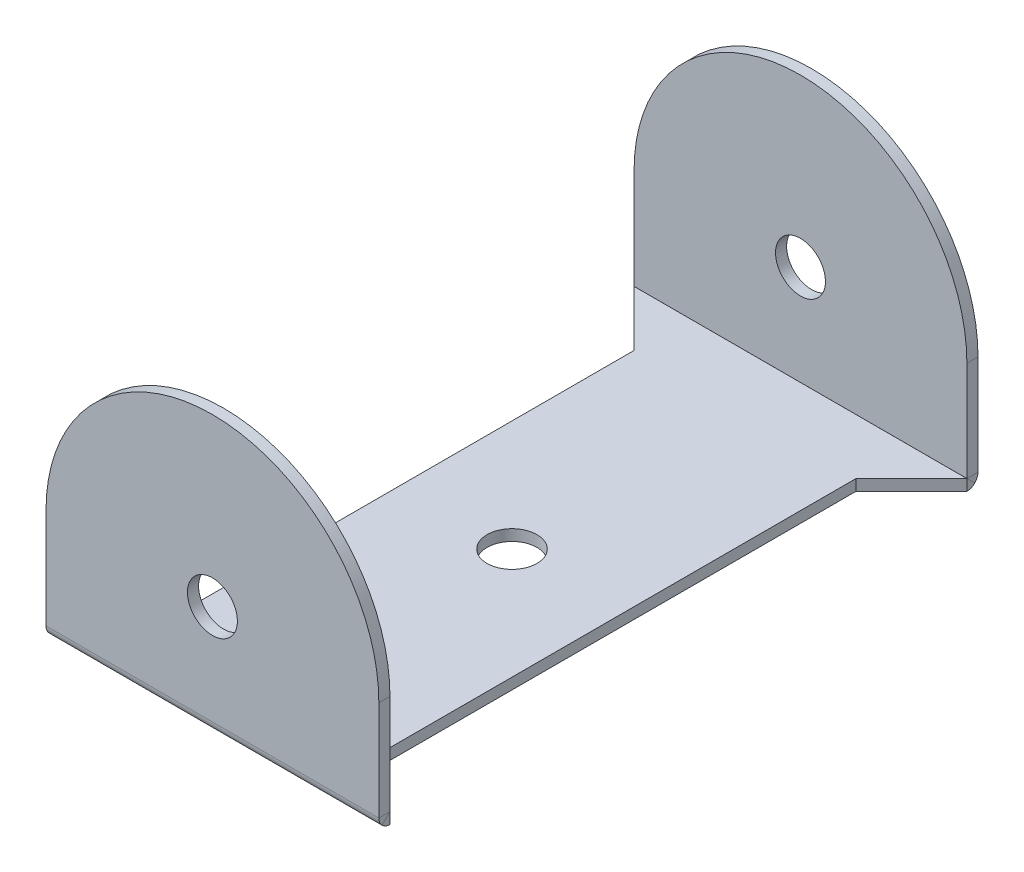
ISO-10303-21;
HEADER;
FILE_DESCRIPTION(('STEP AP214'),'2;1');
FILE_NAME('part.step','',(''),(''),'','','');
FILE_SCHEMA(('AUTOMOTIVE_DESIGN { 1 0 10303 214 1 1 1 1 }'));
ENDSEC;
DATA;
#1=APPLICATION_CONTEXT('core data for automotive mechanical design processes');
#2=APPLICATION_PROTOCOL_DEFINITION('international standard','automotive_design',2000,#1);
#3=PRODUCT_CONTEXT('',#1,'mechanical');
#4=PRODUCT('Part','Part','',(#3));
#5=PRODUCT_RELATED_PRODUCT_CATEGORY('part','',(#4));
#6=PRODUCT_DEFINITION_FORMATION('','',#4);
#7=PRODUCT_DEFINITION_CONTEXT('part definition',#1,'design');
#8=PRODUCT_DEFINITION('design','',#6,#7);
#9=PRODUCT_DEFINITION_SHAPE('','',#8);
#10=(LENGTH_UNIT() NAMED_UNIT(*) SI_UNIT(.MILLI.,.METRE.));
#11=(NAMED_UNIT(*) PLANE_ANGLE_UNIT() SI_UNIT($,.RADIAN.));
#12=(NAMED_UNIT(*) SI_UNIT($,.STERADIAN.) SOLID_ANGLE_UNIT());
#13=UNCERTAINTY_MEASURE_WITH_UNIT(LENGTH_MEASURE(1.E-05),#10,'distance_accuracy_value','');
#14=(GEOMETRIC_REPRESENTATION_CONTEXT(3) GLOBAL_UNCERTAINTY_ASSIGNED_CONTEXT((#13)) GLOBAL_UNIT_ASSIGNED_CONTEXT((#10,
#11,#12)) REPRESENTATION_CONTEXT('',''));
#15=CARTESIAN_POINT('',(0.,0.,0.));
#16=DIRECTION('',(0.,0.,1.));
#17=DIRECTION('',(1.,0.,0.));
#18=AXIS2_PLACEMENT_3D('',#15,#16,#17);
#19=CARTESIAN_POINT('',(10.,1.,-35.));
#20=DIRECTION('',(0.,1.,0.));
#21=DIRECTION('',(0.,0.,1.));
#22=AXIS2_PLACEMENT_3D('',#19,#20,#21);
#23=PLANE('',#22);
#24=CARTESIAN_POINT('',(10.,1.,0.));
#25=DIRECTION('',(0.,1.,0.));
#26=DIRECTION('',(0.,0.,1.));
#27=AXIS2_PLACEMENT_3D('',#24,#25,#26);
#28=CIRCLE('',#27,2.25);
#29=CARTESIAN_POINT('',(10.,1.,2.25));
#30=VERTEX_POINT('',#29);
#31=EDGE_CURVE('E723',#30,#30,#28,.T.);
#32=ORIENTED_EDGE('',*,*,#31,.F.);
#33=EDGE_LOOP('',(#32));
#34=FACE_BOUND('',#33,.T.);
#35=DIRECTION('',(-0.707106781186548,0.,0.707106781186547));
#36=VECTOR('',#35,1.);
#37=CARTESIAN_POINT('',(0.,1.,21.));
#38=LINE('',#37,#36);
#39=CARTESIAN_POINT('',(0.,1.,21.));
#40=VERTEX_POINT('',#39);
#41=CARTESIAN_POINT('',(-4.99920674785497,1.,25.999206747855));
#42=VERTEX_POINT('',#41);
#43=EDGE_CURVE('E503',#40,#42,#38,.T.);
#44=ORIENTED_EDGE('',*,*,#43,.T.);
#45=DIRECTION('',(1.,0.,0.));
#46=VECTOR('',#45,1.);
#47=CARTESIAN_POINT('',(9.99999999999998,1.,25.999206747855));
#48=LINE('',#47,#46);
#49=CARTESIAN_POINT('',(24.999206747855,1.,25.999206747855));
#50=VERTEX_POINT('',#49);
#51=EDGE_CURVE('E411',#42,#50,#48,.T.);
#52=ORIENTED_EDGE('',*,*,#51,.T.);
#53=DIRECTION('',(-0.707106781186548,0.,-0.707106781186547));
#54=VECTOR('',#53,1.);
#55=CARTESIAN_POINT('',(20.,1.,21.));
#56=LINE('',#55,#54);
#57=CARTESIAN_POINT('',(20.,1.,21.));
#58=VERTEX_POINT('',#57);
#59=EDGE_CURVE('E509',#50,#58,#56,.T.);
#60=ORIENTED_EDGE('',*,*,#59,.T.);
#61=DIRECTION('',(0.,0.,-1.));
#62=VECTOR('',#61,1.);
#63=CARTESIAN_POINT('',(20.,1.,21.));
#64=LINE('',#63,#62);
#65=CARTESIAN_POINT('',(20.,1.,-21.));
#66=VERTEX_POINT('',#65);
#67=EDGE_CURVE('E511',#58,#66,#64,.T.);
#68=ORIENTED_EDGE('',*,*,#67,.T.);
#69=DIRECTION('',(0.707106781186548,0.,-0.707106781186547));
#70=VECTOR('',#69,1.);
#71=CARTESIAN_POINT('',(20.,1.,-21.));
#72=LINE('',#71,#70);
#73=CARTESIAN_POINT('',(24.999206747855,1.,-25.999206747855));
#74=VERTEX_POINT('',#73);
#75=EDGE_CURVE('E524',#66,#74,#72,.T.);
#76=ORIENTED_EDGE('',*,*,#75,.T.);
#77=DIRECTION('',(-1.,0.,0.));
#78=VECTOR('',#77,1.);
#79=CARTESIAN_POINT('',(9.99999999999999,1.,-25.999206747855));
#80=LINE('',#79,#78);
#81=CARTESIAN_POINT('',(-4.99920674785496,1.,-25.999206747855));
#82=VERTEX_POINT('',#81);
#83=EDGE_CURVE('E538',#74,#82,#80,.T.);
#84=ORIENTED_EDGE('',*,*,#83,.T.);
#85=DIRECTION('',(0.707106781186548,0.,0.707106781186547));
#86=VECTOR('',#85,1.);
#87=CARTESIAN_POINT('',(0.,1.,-21.));
#88=LINE('',#87,#86);
#89=CARTESIAN_POINT('',(0.,1.,-21.));
#90=VERTEX_POINT('',#89);
#91=EDGE_CURVE('E513',#82,#90,#88,.T.);
#92=ORIENTED_EDGE('',*,*,#91,.T.);
#93=DIRECTION('',(0.,0.,1.));
#94=VECTOR('',#93,1.);
#95=CARTESIAN_POINT('',(0.,1.,21.));
#96=LINE('',#95,#94);
#97=EDGE_CURVE('E510',#90,#40,#96,.T.);
#98=ORIENTED_EDGE('',*,*,#97,.T.);
#99=EDGE_LOOP('',(#44,#52,#60,#68,#76,#84,#92,#98));
#100=FACE_BOUND('',#99,.T.);
#101=ADVANCED_FACE('F67',(#34,#100),#23,.T.);
#102=CARTESIAN_POINT('',(10.,0.,-35.));
#103=DIRECTION('',(0.,1.,0.));
#104=DIRECTION('',(0.,0.,1.));
#105=AXIS2_PLACEMENT_3D('',#102,#103,#104);
#106=PLANE('',#105);
#107=DIRECTION('',(1.,0.,0.));
#108=VECTOR('',#107,1.);
#109=CARTESIAN_POINT('',(9.99999999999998,0.,25.999206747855));
#110=LINE('',#109,#108);
#111=CARTESIAN_POINT('',(-4.99920674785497,0.,25.999206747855));
#112=VERTEX_POINT('',#111);
#113=CARTESIAN_POINT('',(24.999206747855,0.,25.999206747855));
#114=VERTEX_POINT('',#113);
#115=EDGE_CURVE('E76',#112,#114,#110,.T.);
#116=ORIENTED_EDGE('',*,*,#115,.F.);
#117=DIRECTION('',(-0.707106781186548,0.,0.707106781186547));
#118=VECTOR('',#117,1.);
#119=CARTESIAN_POINT('',(0.,0.,21.));
#120=LINE('',#119,#118);
#121=CARTESIAN_POINT('',(0.,0.,21.));
#122=VERTEX_POINT('',#121);
#123=EDGE_CURVE('E91',#122,#112,#120,.T.);
#124=ORIENTED_EDGE('',*,*,#123,.F.);
#125=DIRECTION('',(0.,0.,1.));
#126=VECTOR('',#125,1.);
#127=CARTESIAN_POINT('',(0.,0.,21.));
#128=LINE('',#127,#126);
#129=CARTESIAN_POINT('',(0.,0.,-21.));
#130=VERTEX_POINT('',#129);
#131=EDGE_CURVE('E498',#130,#122,#128,.T.);
#132=ORIENTED_EDGE('',*,*,#131,.F.);
#133=DIRECTION('',(0.707106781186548,0.,0.707106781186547));
#134=VECTOR('',#133,1.);
#135=CARTESIAN_POINT('',(0.,0.,-21.));
#136=LINE('',#135,#134);
#137=CARTESIAN_POINT('',(-4.99920674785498,0.,-25.999206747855));
#138=VERTEX_POINT('',#137);
#139=EDGE_CURVE('E526',#138,#130,#136,.T.);
#140=ORIENTED_EDGE('',*,*,#139,.F.);
#141=DIRECTION('',(-1.,0.,0.));
#142=VECTOR('',#141,1.);
#143=CARTESIAN_POINT('',(9.99999999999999,0.,-25.999206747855));
#144=LINE('',#143,#142);
#145=CARTESIAN_POINT('',(24.999206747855,0.,-25.999206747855));
#146=VERTEX_POINT('',#145);
#147=EDGE_CURVE('E556',#146,#138,#144,.T.);
#148=ORIENTED_EDGE('',*,*,#147,.F.);
#149=DIRECTION('',(0.707106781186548,0.,-0.707106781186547));
#150=VECTOR('',#149,1.);
#151=CARTESIAN_POINT('',(20.,0.,-21.));
#152=LINE('',#151,#150);
#153=CARTESIAN_POINT('',(20.,0.,-21.));
#154=VERTEX_POINT('',#153);
#155=EDGE_CURVE('E517',#154,#146,#152,.T.);
#156=ORIENTED_EDGE('',*,*,#155,.F.);
#157=DIRECTION('',(0.,0.,-1.));
#158=VECTOR('',#157,1.);
#159=CARTESIAN_POINT('',(20.,0.,21.));
#160=LINE('',#159,#158);
#161=CARTESIAN_POINT('',(20.,0.,21.));
#162=VERTEX_POINT('',#161);
#163=EDGE_CURVE('E494',#162,#154,#160,.T.);
#164=ORIENTED_EDGE('',*,*,#163,.F.);
#165=DIRECTION('',(-0.707106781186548,0.,-0.707106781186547));
#166=VECTOR('',#165,1.);
#167=CARTESIAN_POINT('',(20.,0.,21.));
#168=LINE('',#167,#166);
#169=EDGE_CURVE('E83',#114,#162,#168,.T.);
#170=ORIENTED_EDGE('',*,*,#169,.F.);
#171=EDGE_LOOP('',(#116,#124,#132,#140,#148,#156,#164,#170));
#172=FACE_BOUND('',#171,.T.);
#173=CARTESIAN_POINT('',(10.,0.,0.));
#174=DIRECTION('',(0.,1.,0.));
#175=DIRECTION('',(0.,0.,1.));
#176=AXIS2_PLACEMENT_3D('',#173,#174,#175);
#177=CIRCLE('',#176,2.25);
#178=CARTESIAN_POINT('',(10.,0.,2.25));
#179=VERTEX_POINT('',#178);
#180=EDGE_CURVE('E521',#179,#179,#177,.T.);
#181=ORIENTED_EDGE('',*,*,#180,.T.);
#182=EDGE_LOOP('',(#181));
#183=FACE_BOUND('',#182,.T.);
#184=ADVANCED_FACE('F69',(#172,#183),#106,.F.);
#185=CARTESIAN_POINT('',(0.,1.,-21.));
#186=DIRECTION('',(0.707106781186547,0.,-0.707106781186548));
#187=DIRECTION('',(-0.707106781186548,0.,-0.707106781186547));
#188=AXIS2_PLACEMENT_3D('',#185,#186,#187);
#189=PLANE('',#188);
#190=CARTESIAN_POINT('',(-4.99920674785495,0.,-25.999206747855));
#191=CARTESIAN_POINT('',(-4.99920674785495,1.,-25.999206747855));
#192=B_SPLINE_CURVE_WITH_KNOTS('',1,(#190,#191),.UNSPECIFIED.,.F.,.F.,(2,2),(0.,1.),.UNSPECIFIED.);
#193=EDGE_CURVE('E551',#138,#82,#192,.T.);
#194=ORIENTED_EDGE('',*,*,#193,.F.);
#195=ORIENTED_EDGE('',*,*,#139,.T.);
#196=DIRECTION('',(0.,-1.,0.));
#197=VECTOR('',#196,1.);
#198=CARTESIAN_POINT('',(0.,1.,-21.));
#199=LINE('',#198,#197);
#200=EDGE_CURVE('E536',#90,#130,#199,.T.);
#201=ORIENTED_EDGE('',*,*,#200,.F.);
#202=ORIENTED_EDGE('',*,*,#91,.F.);
#203=EDGE_LOOP('',(#194,#195,#201,#202));
#204=FACE_BOUND('',#203,.T.);
#205=ADVANCED_FACE('F466',(#204),#189,.F.);
#206=CARTESIAN_POINT('',(0.,1.,21.));
#207=DIRECTION('',(1.,0.,0.));
#208=DIRECTION('',(0.,0.,-1.));
#209=AXIS2_PLACEMENT_3D('',#206,#207,#208);
#210=PLANE('',#209);
#211=ORIENTED_EDGE('',*,*,#131,.T.);
#212=DIRECTION('',(0.,-1.,0.));
#213=VECTOR('',#212,1.);
#214=CARTESIAN_POINT('',(0.,1.,21.));
#215=LINE('',#214,#213);
#216=EDGE_CURVE('E534',#40,#122,#215,.T.);
#217=ORIENTED_EDGE('',*,*,#216,.F.);
#218=ORIENTED_EDGE('',*,*,#97,.F.);
#219=ORIENTED_EDGE('',*,*,#200,.T.);
#220=EDGE_LOOP('',(#211,#217,#218,#219));
#221=FACE_BOUND('',#220,.T.);
#222=ADVANCED_FACE('F566',(#221),#210,.F.);
#223=CARTESIAN_POINT('',(0.,1.,21.));
#224=DIRECTION('',(0.707106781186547,0.,0.707106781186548));
#225=DIRECTION('',(0.707106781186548,0.,-0.707106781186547));
#226=AXIS2_PLACEMENT_3D('',#223,#224,#225);
#227=PLANE('',#226);
#228=CARTESIAN_POINT('',(-4.99920674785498,1.,25.999206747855));
#229=CARTESIAN_POINT('',(-4.99920674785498,0.,25.9992067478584));
#230=B_SPLINE_CURVE_WITH_KNOTS('',1,(#228,#229),.UNSPECIFIED.,.F.,.F.,(2,2),(0.,1.),.UNSPECIFIED.);
#231=EDGE_CURVE('E397',#42,#112,#230,.T.);
#232=ORIENTED_EDGE('',*,*,#231,.F.);
#233=ORIENTED_EDGE('',*,*,#43,.F.);
#234=ORIENTED_EDGE('',*,*,#216,.T.);
#235=ORIENTED_EDGE('',*,*,#123,.T.);
#236=EDGE_LOOP('',(#232,#233,#234,#235));
#237=FACE_BOUND('',#236,.T.);
#238=ADVANCED_FACE('F475',(#237),#227,.F.);
#239=CARTESIAN_POINT('',(20.,1.,21.));
#240=DIRECTION('',(-0.707106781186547,0.,0.707106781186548));
#241=DIRECTION('',(0.707106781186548,0.,0.707106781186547));
#242=AXIS2_PLACEMENT_3D('',#239,#240,#241);
#243=PLANE('',#242);
#244=CARTESIAN_POINT('',(24.9992067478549,0.,25.9992067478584));
#245=CARTESIAN_POINT('',(24.9992067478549,1.,25.999206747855));
#246=B_SPLINE_CURVE_WITH_KNOTS('',1,(#244,#245),.UNSPECIFIED.,.F.,.F.,(2,2),(0.,1.),.UNSPECIFIED.);
#247=EDGE_CURVE('E12',#114,#50,#246,.T.);
#248=ORIENTED_EDGE('',*,*,#247,.F.);
#249=ORIENTED_EDGE('',*,*,#169,.T.);
#250=DIRECTION('',(0.,-1.,0.));
#251=VECTOR('',#250,1.);
#252=CARTESIAN_POINT('',(20.,1.,21.));
#253=LINE('',#252,#251);
#254=EDGE_CURVE('E531',#58,#162,#253,.T.);
#255=ORIENTED_EDGE('',*,*,#254,.F.);
#256=ORIENTED_EDGE('',*,*,#59,.F.);
#257=EDGE_LOOP('',(#248,#249,#255,#256));
#258=FACE_BOUND('',#257,.T.);
#259=ADVANCED_FACE('F470',(#258),#243,.F.);
#260=CARTESIAN_POINT('',(20.,1.,21.));
#261=DIRECTION('',(-1.,0.,0.));
#262=DIRECTION('',(0.,0.,1.));
#263=AXIS2_PLACEMENT_3D('',#260,#261,#262);
#264=PLANE('',#263);
#265=ORIENTED_EDGE('',*,*,#163,.T.);
#266=DIRECTION('',(0.,-1.,0.));
#267=VECTOR('',#266,1.);
#268=CARTESIAN_POINT('',(20.,1.,-21.));
#269=LINE('',#268,#267);
#270=EDGE_CURVE('E528',#66,#154,#269,.T.);
#271=ORIENTED_EDGE('',*,*,#270,.F.);
#272=ORIENTED_EDGE('',*,*,#67,.F.);
#273=ORIENTED_EDGE('',*,*,#254,.T.);
#274=EDGE_LOOP('',(#265,#271,#272,#273));
#275=FACE_BOUND('',#274,.T.);
#276=ADVANCED_FACE('F474',(#275),#264,.F.);
#277=CARTESIAN_POINT('',(20.,1.,-21.));
#278=DIRECTION('',(-0.707106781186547,0.,-0.707106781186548));
#279=DIRECTION('',(-0.707106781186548,0.,0.707106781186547));
#280=AXIS2_PLACEMENT_3D('',#277,#278,#279);
#281=PLANE('',#280);
#282=CARTESIAN_POINT('',(24.999206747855,1.,-25.999206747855));
#283=CARTESIAN_POINT('',(24.999206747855,0.,-25.999206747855));
#284=B_SPLINE_CURVE_WITH_KNOTS('',1,(#282,#283),.UNSPECIFIED.,.F.,.F.,(2,2),(0.,1.),.UNSPECIFIED.);
#285=EDGE_CURVE('E544',#74,#146,#284,.T.);
#286=ORIENTED_EDGE('',*,*,#285,.F.);
#287=ORIENTED_EDGE('',*,*,#75,.F.);
#288=ORIENTED_EDGE('',*,*,#270,.T.);
#289=ORIENTED_EDGE('',*,*,#155,.T.);
#290=EDGE_LOOP('',(#286,#287,#288,#289));
#291=FACE_BOUND('',#290,.T.);
#292=ADVANCED_FACE('F567',(#291),#281,.F.);
#293=CARTESIAN_POINT('',(10.,1.,0.));
#294=DIRECTION('',(0.,-1.,0.));
#295=DIRECTION('',(0.,0.,-1.));
#296=AXIS2_PLACEMENT_3D('',#293,#294,#295);
#297=CYLINDRICAL_SURFACE('',#296,2.25);
#298=ORIENTED_EDGE('',*,*,#31,.T.);
#299=EDGE_LOOP('',(#298));
#300=FACE_BOUND('',#299,.T.);
#301=ORIENTED_EDGE('',*,*,#180,.F.);
#302=EDGE_LOOP('',(#301));
#303=FACE_BOUND('',#302,.T.);
#304=ADVANCED_FACE('F571',(#300,#303),#297,.F.);
#305=CARTESIAN_POINT('',(24.999206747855,0.,-25.999206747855));
#306=CARTESIAN_POINT('',(24.9993375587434,0.,-26.1302609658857));
#307=CARTESIAN_POINT('',(24.9994690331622,0.0260533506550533,-26.2612163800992));
#308=CARTESIAN_POINT('',(24.9997334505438,0.126339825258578,-26.5033293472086));
#309=CARTESIAN_POINT('',(24.9998663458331,0.200516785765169,-26.6143513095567));
#310=CARTESIAN_POINT('',(25.,0.293186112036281,-26.7070206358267));
#311=CARTESIAN_POINT('',(24.999206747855,1.,-25.999206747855));
#312=CARTESIAN_POINT('',(24.9993375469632,1.,-25.9993376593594));
#313=CARTESIAN_POINT('',(24.9994690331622,1.00002602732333,-25.9994684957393));
#314=CARTESIAN_POINT('',(24.9997334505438,1.00012621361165,-25.9997103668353));
#315=CARTESIAN_POINT('',(24.9998663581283,1.00020032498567,-25.999821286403));
#316=CARTESIAN_POINT('',(25.,1.00029289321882,-25.9999138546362));
#317=B_SPLINE_SURFACE_WITH_KNOTS('',1,3,((#305,#306,#307,#308,#309,#310),(#311,#312,#313,#314,
#315,#316)),.UNSPECIFIED.,.F.,.F.,.F.,(2,2),(4,2,4),(0.,1.),(0.,0.5,1.),.UNSPECIFIED.);
#318=CARTESIAN_POINT('',(24.999206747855,0.,-25.999206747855));
#319=CARTESIAN_POINT('',(24.9993375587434,0.,-26.1302609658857));
#320=CARTESIAN_POINT('',(24.9994690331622,0.0260533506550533,-26.2612163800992));
#321=CARTESIAN_POINT('',(24.9997334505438,0.126339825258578,-26.5033293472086));
#322=CARTESIAN_POINT('',(24.9998663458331,0.200516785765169,-26.6143513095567));
#323=CARTESIAN_POINT('',(25.,0.293186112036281,-26.7070206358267));
#324=B_SPLINE_CURVE_WITH_KNOTS('',3,(#318,#319,#320,#321,#322,#323),.UNSPECIFIED.,.F.,.F.,(4,2,
4),(0.,0.5,1.),.UNSPECIFIED.);
#325=CARTESIAN_POINT('',(25.,0.29318611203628,-26.7070206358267));
#326=VERTEX_POINT('',#325);
#327=EDGE_CURVE('E607',#146,#326,#324,.T.);
#328=CARTESIAN_POINT('',(25.,0.293186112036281,-26.7070206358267));
#329=CARTESIAN_POINT('',(25.,1.00029289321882,-25.9999138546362));
#330=B_SPLINE_CURVE_WITH_KNOTS('',1,(#328,#329),.UNSPECIFIED.,.F.,.F.,(2,2),(0.,1.),.UNSPECIFIED.);
#331=CARTESIAN_POINT('',(25.,1.00029289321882,-25.9999138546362));
#332=VERTEX_POINT('',#331);
#333=EDGE_CURVE('E733',#326,#332,#330,.T.);
#334=CARTESIAN_POINT('',(25.,1.00029289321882,-25.9999138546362));
#335=CARTESIAN_POINT('',(24.9998663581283,1.00020032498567,-25.999821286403));
#336=CARTESIAN_POINT('',(24.9997334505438,1.00012621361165,-25.9997103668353));
#337=CARTESIAN_POINT('',(24.9994690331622,1.00002602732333,-25.9994684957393));
#338=CARTESIAN_POINT('',(24.9993375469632,1.,-25.9993376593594));
#339=CARTESIAN_POINT('',(24.999206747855,1.,-25.999206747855));
#340=B_SPLINE_CURVE_WITH_KNOTS('',3,(#334,#335,#336,#337,#338,#339),.UNSPECIFIED.,.F.,.F.,(4,2,
4),(0.,0.5,1.),.UNSPECIFIED.);
#341=EDGE_CURVE('E610',#74,#332,#340,.F.);
#342=ORIENTED_EDGE('',*,*,#285,.T.);
#343=ORIENTED_EDGE('',*,*,#327,.T.);
#344=ORIENTED_EDGE('',*,*,#333,.T.);
#345=ORIENTED_EDGE('',*,*,#341,.F.);
#346=EDGE_LOOP('',(#342,#343,#344,#345));
#347=FACE_BOUND('',#346,.T.);
#348=ADVANCED_FACE('F606',(#347),#317,.F.);
#349=CARTESIAN_POINT('',(25.,1.001,-25.999206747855));
#350=DIRECTION('',(-1.,0.,0.));
#351=DIRECTION('',(0.,0.,1.));
#352=AXIS2_PLACEMENT_3D('',#349,#350,#351);
#353=PLANE('',#352);
#354=ORIENTED_EDGE('',*,*,#333,.F.);
#355=CARTESIAN_POINT('',(25.,1.001,-25.999206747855));
#356=DIRECTION('',(-1.,0.,0.));
#357=DIRECTION('',(0.,0.,1.));
#358=AXIS2_PLACEMENT_3D('',#355,#356,#357);
#359=CIRCLE('',#358,1.001);
#360=CARTESIAN_POINT('',(25.,1.00100000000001,-27.000206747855));
#361=VERTEX_POINT('',#360);
#362=EDGE_CURVE('E622',#326,#361,#359,.F.);
#363=ORIENTED_EDGE('',*,*,#362,.T.);
#364=DIRECTION('',(0.,0.,-1.));
#365=VECTOR('',#364,1.);
#366=CARTESIAN_POINT('',(25.,1.00100000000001,-26.000206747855));
#367=LINE('',#366,#365);
#368=CARTESIAN_POINT('',(25.,1.00100000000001,-26.000206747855));
#369=VERTEX_POINT('',#368);
#370=EDGE_CURVE('E801',#369,#361,#367,.T.);
#371=ORIENTED_EDGE('',*,*,#370,.F.);
#372=CARTESIAN_POINT('',(25.,1.001,-25.999206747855));
#373=DIRECTION('',(1.,0.,0.));
#374=DIRECTION('',(0.,0.,-1.));
#375=AXIS2_PLACEMENT_3D('',#372,#373,#374);
#376=CIRCLE('',#375,0.00100000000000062);
#377=EDGE_CURVE('E742',#332,#369,#376,.T.);
#378=ORIENTED_EDGE('',*,*,#377,.F.);
#379=EDGE_LOOP('',(#354,#363,#371,#378));
#380=FACE_BOUND('',#379,.T.);
#381=ADVANCED_FACE('F843',(#380),#353,.F.);
#382=CARTESIAN_POINT('',(-4.99999999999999,1.001,-25.999206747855));
#383=DIRECTION('',(1.,0.,0.));
#384=DIRECTION('',(0.,0.,-1.));
#385=AXIS2_PLACEMENT_3D('',#382,#383,#384);
#386=PLANE('',#385);
#387=DIRECTION('',(0.,0.,1.));
#388=VECTOR('',#387,1.);
#389=CARTESIAN_POINT('',(-5.,1.001,-26.000206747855));
#390=LINE('',#389,#388);
#391=CARTESIAN_POINT('',(-5.,1.001,-27.000206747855));
#392=VERTEX_POINT('',#391);
#393=CARTESIAN_POINT('',(-4.99999999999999,1.001,-26.000206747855));
#394=VERTEX_POINT('',#393);
#395=EDGE_CURVE('E814',#392,#394,#390,.T.);
#396=ORIENTED_EDGE('',*,*,#395,.F.);
#397=CARTESIAN_POINT('',(-4.99999999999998,1.001,-25.999206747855));
#398=DIRECTION('',(-1.,0.,0.));
#399=DIRECTION('',(0.,0.,1.));
#400=AXIS2_PLACEMENT_3D('',#397,#398,#399);
#401=CIRCLE('',#400,1.001);
#402=CARTESIAN_POINT('',(-4.99999999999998,0.293186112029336,-26.7070206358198));
#403=VERTEX_POINT('',#402);
#404=EDGE_CURVE('E655',#392,#403,#401,.T.);
#405=ORIENTED_EDGE('',*,*,#404,.T.);
#406=CARTESIAN_POINT('',(-4.99999999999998,1.00029289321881,-25.9999138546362));
#407=CARTESIAN_POINT('',(-4.99999999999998,0.293186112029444,-26.7070206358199));
#408=B_SPLINE_CURVE_WITH_KNOTS('',1,(#406,#407),.UNSPECIFIED.,.F.,.F.,(2,2),(0.,1.),.UNSPECIFIED.);
#409=CARTESIAN_POINT('',(-4.99999999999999,1.00029289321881,-25.9999138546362));
#410=VERTEX_POINT('',#409);
#411=EDGE_CURVE('E711',#403,#410,#408,.F.);
#412=ORIENTED_EDGE('',*,*,#411,.T.);
#413=CARTESIAN_POINT('',(-4.99999999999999,1.001,-25.999206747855));
#414=DIRECTION('',(-1.,0.,0.));
#415=DIRECTION('',(0.,0.,1.));
#416=AXIS2_PLACEMENT_3D('',#413,#414,#415);
#417=CIRCLE('',#416,0.00100000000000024);
#418=EDGE_CURVE('E737',#394,#410,#417,.T.);
#419=ORIENTED_EDGE('',*,*,#418,.F.);
#420=EDGE_LOOP('',(#396,#405,#412,#419));
#421=FACE_BOUND('',#420,.T.);
#422=ADVANCED_FACE('F645',(#421),#386,.F.);
#423=CARTESIAN_POINT('',(-4.99999999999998,0.293186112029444,-26.7070206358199));
#424=CARTESIAN_POINT('',(-4.99986918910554,0.200516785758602,-26.6143513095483));
#425=CARTESIAN_POINT('',(-4.99973771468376,0.126339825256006,-26.5033293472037));
#426=CARTESIAN_POINT('',(-4.99947329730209,0.0260533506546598,-26.261216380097));
#427=CARTESIAN_POINT('',(-4.99934040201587,0.,-26.1302609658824));
#428=CARTESIAN_POINT('',(-4.99920674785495,0.,-25.999206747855));
#429=CARTESIAN_POINT('',(-4.99999999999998,1.00029289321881,-25.9999138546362));
#430=CARTESIAN_POINT('',(-4.99986920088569,1.00020032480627,-25.9998212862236));
#431=CARTESIAN_POINT('',(-4.99973771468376,1.00012621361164,-25.9997103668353));
#432=CARTESIAN_POINT('',(-4.99947329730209,1.00002602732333,-25.9994684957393));
#433=CARTESIAN_POINT('',(-4.99934038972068,1.,-25.9993376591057));
#434=CARTESIAN_POINT('',(-4.99920674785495,1.,-25.999206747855));
#435=B_SPLINE_SURFACE_WITH_KNOTS('',1,3,((#423,#424,#425,#426,#427,#428),(#429,#430,#431,#432,
#433,#434)),.UNSPECIFIED.,.F.,.F.,.F.,(2,2),(4,2,4),(0.,1.),(0.,0.5,1.),.UNSPECIFIED.);
#436=CARTESIAN_POINT('',(-4.99999999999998,0.293186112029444,-26.7070206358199));
#437=CARTESIAN_POINT('',(-4.99986918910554,0.200516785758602,-26.6143513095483));
#438=CARTESIAN_POINT('',(-4.99973771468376,0.126339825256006,-26.5033293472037));
#439=CARTESIAN_POINT('',(-4.99947329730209,0.0260533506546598,-26.261216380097));
#440=CARTESIAN_POINT('',(-4.99934040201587,0.,-26.1302609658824));
#441=CARTESIAN_POINT('',(-4.99920674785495,0.,-25.999206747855));
#442=B_SPLINE_CURVE_WITH_KNOTS('',3,(#436,#437,#438,#439,#440,#441),.UNSPECIFIED.,.F.,.F.,(4,2,
4),(0.,0.5,1.),.UNSPECIFIED.);
#443=EDGE_CURVE('E663',#403,#138,#442,.T.);
#444=CARTESIAN_POINT('',(-4.99920674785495,1.,-25.999206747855));
#445=CARTESIAN_POINT('',(-4.99934038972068,1.,-25.9993376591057));
#446=CARTESIAN_POINT('',(-4.99947329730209,1.00002602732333,-25.9994684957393));
#447=CARTESIAN_POINT('',(-4.99973771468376,1.00012621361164,-25.9997103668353));
#448=CARTESIAN_POINT('',(-4.99986920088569,1.00020032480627,-25.9998212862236));
#449=CARTESIAN_POINT('',(-4.99999999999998,1.00029289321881,-25.9999138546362));
#450=B_SPLINE_CURVE_WITH_KNOTS('',3,(#444,#445,#446,#447,#448,#449),.UNSPECIFIED.,.F.,.F.,(4,2,
4),(0.,0.5,1.),.UNSPECIFIED.);
#451=EDGE_CURVE('E667',#410,#82,#450,.F.);
#452=ORIENTED_EDGE('',*,*,#443,.T.);
#453=ORIENTED_EDGE('',*,*,#193,.T.);
#454=ORIENTED_EDGE('',*,*,#451,.F.);
#455=ORIENTED_EDGE('',*,*,#411,.F.);
#456=EDGE_LOOP('',(#452,#453,#454,#455));
#457=FACE_BOUND('',#456,.T.);
#458=ADVANCED_FACE('F642',(#457),#435,.F.);
#459=CARTESIAN_POINT('',(40.0166620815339,1.001,-25.999206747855));
#460=DIRECTION('',(-1.,0.,0.));
#461=DIRECTION('',(0.,0.,1.));
#462=AXIS2_PLACEMENT_3D('',#459,#460,#461);
#463=CYLINDRICAL_SURFACE('',#462,0.001);
#464=ORIENTED_EDGE('',*,*,#418,.T.);
#465=ORIENTED_EDGE('',*,*,#451,.T.);
#466=ORIENTED_EDGE('',*,*,#83,.F.);
#467=ORIENTED_EDGE('',*,*,#341,.T.);
#468=ORIENTED_EDGE('',*,*,#377,.T.);
#469=DIRECTION('',(-1.,0.,0.));
#470=VECTOR('',#469,1.);
#471=CARTESIAN_POINT('',(9.99999999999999,1.001,-26.000206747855));
#472=LINE('',#471,#470);
#473=EDGE_CURVE('E784',#369,#394,#472,.T.);
#474=ORIENTED_EDGE('',*,*,#473,.T.);
#475=EDGE_LOOP('',(#464,#465,#466,#467,#468,#474));
#476=FACE_BOUND('',#475,.T.);
#477=ADVANCED_FACE('F641',(#476),#463,.F.);
#478=CARTESIAN_POINT('',(40.0166620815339,1.001,-25.999206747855));
#479=DIRECTION('',(-1.,0.,0.));
#480=DIRECTION('',(0.,0.,1.));
#481=AXIS2_PLACEMENT_3D('',#478,#479,#480);
#482=CYLINDRICAL_SURFACE('',#481,1.001);
#483=ORIENTED_EDGE('',*,*,#404,.F.);
#484=DIRECTION('',(-1.,0.,0.));
#485=VECTOR('',#484,1.);
#486=CARTESIAN_POINT('',(10.,1.00100000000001,-27.000206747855));
#487=LINE('',#486,#485);
#488=EDGE_CURVE('E809',#361,#392,#487,.T.);
#489=ORIENTED_EDGE('',*,*,#488,.F.);
#490=ORIENTED_EDGE('',*,*,#362,.F.);
#491=ORIENTED_EDGE('',*,*,#327,.F.);
#492=ORIENTED_EDGE('',*,*,#147,.T.);
#493=ORIENTED_EDGE('',*,*,#443,.F.);
#494=EDGE_LOOP('',(#483,#489,#490,#491,#492,#493));
#495=FACE_BOUND('',#494,.T.);
#496=ADVANCED_FACE('F619',(#495),#482,.T.);
#497=CARTESIAN_POINT('',(9.99999999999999,10.000206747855,-26.0002067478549));
#498=DIRECTION('',(0.,0.,-1.));
#499=DIRECTION('',(0.,1.,0.));
#500=AXIS2_PLACEMENT_3D('',#497,#498,#499);
#501=CYLINDRICAL_SURFACE('',#500,2.25);
#502=CARTESIAN_POINT('',(9.99999999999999,10.000206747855,-26.0002067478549));
#503=DIRECTION('',(0.,0.,1.));
#504=DIRECTION('',(0.,-1.,0.));
#505=AXIS2_PLACEMENT_3D('',#502,#503,#504);
#506=CIRCLE('',#505,2.25);
#507=CARTESIAN_POINT('',(9.99999999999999,7.75020674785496,-26.0002067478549));
#508=VERTEX_POINT('',#507);
#509=EDGE_CURVE('E786',#508,#508,#506,.T.);
#510=ORIENTED_EDGE('',*,*,#509,.T.);
#511=EDGE_LOOP('',(#510));
#512=FACE_BOUND('',#511,.T.);
#513=CARTESIAN_POINT('',(9.99999999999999,10.000206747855,-27.0002067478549));
#514=DIRECTION('',(0.,0.,1.));
#515=DIRECTION('',(0.,-1.,0.));
#516=AXIS2_PLACEMENT_3D('',#513,#514,#515);
#517=CIRCLE('',#516,2.25);
#518=CARTESIAN_POINT('',(9.99999999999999,7.75020674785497,-27.0002067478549));
#519=VERTEX_POINT('',#518);
#520=EDGE_CURVE('E806',#519,#519,#517,.T.);
#521=ORIENTED_EDGE('',*,*,#520,.F.);
#522=EDGE_LOOP('',(#521));
#523=FACE_BOUND('',#522,.T.);
#524=ADVANCED_FACE('F339',(#512,#523),#501,.F.);
#525=CARTESIAN_POINT('',(9.99999999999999,10.000206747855,-26.0002067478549));
#526=DIRECTION('',(0.,0.,-1.));
#527=DIRECTION('',(0.,1.,0.));
#528=AXIS2_PLACEMENT_3D('',#525,#526,#527);
#529=CYLINDRICAL_SURFACE('',#528,15.);
#530=CARTESIAN_POINT('',(9.99999999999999,10.000206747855,-27.0002067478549));
#531=DIRECTION('',(0.,0.,1.));
#532=DIRECTION('',(0.,-1.,0.));
#533=AXIS2_PLACEMENT_3D('',#530,#531,#532);
#534=CIRCLE('',#533,15.);
#535=CARTESIAN_POINT('',(25.,10.000206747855,-27.0002067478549));
#536=VERTEX_POINT('',#535);
#537=CARTESIAN_POINT('',(-5.,10.000206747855,-27.0002067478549));
#538=VERTEX_POINT('',#537);
#539=EDGE_CURVE('E789',#536,#538,#534,.T.);
#540=ORIENTED_EDGE('',*,*,#539,.T.);
#541=DIRECTION('',(0.,0.,-1.));
#542=VECTOR('',#541,1.);
#543=CARTESIAN_POINT('',(-5.00000000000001,10.000206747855,-26.0002067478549));
#544=LINE('',#543,#542);
#545=CARTESIAN_POINT('',(-5.00000000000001,10.000206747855,-26.0002067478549));
#546=VERTEX_POINT('',#545);
#547=EDGE_CURVE('E623',#546,#538,#544,.T.);
#548=ORIENTED_EDGE('',*,*,#547,.F.);
#549=CARTESIAN_POINT('',(9.99999999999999,10.000206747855,-26.0002067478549));
#550=DIRECTION('',(0.,0.,1.));
#551=DIRECTION('',(0.,-1.,0.));
#552=AXIS2_PLACEMENT_3D('',#549,#550,#551);
#553=CIRCLE('',#552,15.);
#554=CARTESIAN_POINT('',(25.,10.000206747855,-26.0002067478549));
#555=VERTEX_POINT('',#554);
#556=EDGE_CURVE('E796',#555,#546,#553,.T.);
#557=ORIENTED_EDGE('',*,*,#556,.F.);
#558=DIRECTION('',(0.,0.,-1.));
#559=VECTOR('',#558,1.);
#560=CARTESIAN_POINT('',(25.,10.000206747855,-26.0002067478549));
#561=LINE('',#560,#559);
#562=EDGE_CURVE('E791',#555,#536,#561,.T.);
#563=ORIENTED_EDGE('',*,*,#562,.T.);
#564=EDGE_LOOP('',(#540,#548,#557,#563));
#565=FACE_BOUND('',#564,.T.);
#566=ADVANCED_FACE('F872',(#565),#529,.T.);
#567=CARTESIAN_POINT('',(9.99999999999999,10.000206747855,-26.0002067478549));
#568=DIRECTION('',(0.,0.,1.));
#569=DIRECTION('',(0.,-1.,0.));
#570=AXIS2_PLACEMENT_3D('',#567,#568,#569);
#571=PLANE('',#570);
#572=ORIENTED_EDGE('',*,*,#473,.F.);
#573=DIRECTION('',(0.,1.,0.));
#574=VECTOR('',#573,1.);
#575=CARTESIAN_POINT('',(25.,1.00020674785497,-26.000206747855));
#576=LINE('',#575,#574);
#577=EDGE_CURVE('E794',#369,#555,#576,.T.);
#578=ORIENTED_EDGE('',*,*,#577,.T.);
#579=ORIENTED_EDGE('',*,*,#556,.T.);
#580=DIRECTION('',(0.,-1.,0.));
#581=VECTOR('',#580,1.);
#582=CARTESIAN_POINT('',(-5.,1.00020674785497,-26.000206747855));
#583=LINE('',#582,#581);
#584=EDGE_CURVE('E798',#546,#394,#583,.T.);
#585=ORIENTED_EDGE('',*,*,#584,.T.);
#586=EDGE_LOOP('',(#572,#578,#579,#585));
#587=FACE_BOUND('',#586,.T.);
#588=ORIENTED_EDGE('',*,*,#509,.F.);
#589=EDGE_LOOP('',(#588));
#590=FACE_BOUND('',#589,.T.);
#591=ADVANCED_FACE('F836',(#587,#590),#571,.T.);
#592=CARTESIAN_POINT('',(25.,1.00020674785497,-26.000206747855));
#593=DIRECTION('',(-1.,0.,0.));
#594=DIRECTION('',(0.,-1.,0.));
#595=AXIS2_PLACEMENT_3D('',#592,#593,#594);
#596=PLANE('',#595);
#597=ORIENTED_EDGE('',*,*,#577,.F.);
#598=ORIENTED_EDGE('',*,*,#370,.T.);
#599=DIRECTION('',(0.,1.,0.));
#600=VECTOR('',#599,1.);
#601=CARTESIAN_POINT('',(25.,1.00020674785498,-27.000206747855));
#602=LINE('',#601,#600);
#603=EDGE_CURVE('E804',#361,#536,#602,.T.);
#604=ORIENTED_EDGE('',*,*,#603,.T.);
#605=ORIENTED_EDGE('',*,*,#562,.F.);
#606=EDGE_LOOP('',(#597,#598,#604,#605));
#607=FACE_BOUND('',#606,.T.);
#608=ADVANCED_FACE('F870',(#607),#596,.F.);
#609=CARTESIAN_POINT('',(9.99999999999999,10.000206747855,-27.0002067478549));
#610=DIRECTION('',(0.,0.,1.));
#611=DIRECTION('',(0.,-1.,0.));
#612=AXIS2_PLACEMENT_3D('',#609,#610,#611);
#613=PLANE('',#612);
#614=ORIENTED_EDGE('',*,*,#520,.T.);
#615=EDGE_LOOP('',(#614));
#616=FACE_BOUND('',#615,.T.);
#617=ORIENTED_EDGE('',*,*,#603,.F.);
#618=ORIENTED_EDGE('',*,*,#488,.T.);
#619=DIRECTION('',(0.,-1.,0.));
#620=VECTOR('',#619,1.);
#621=CARTESIAN_POINT('',(-5.,1.00020674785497,-27.000206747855));
#622=LINE('',#621,#620);
#623=EDGE_CURVE('E812',#538,#392,#622,.T.);
#624=ORIENTED_EDGE('',*,*,#623,.F.);
#625=ORIENTED_EDGE('',*,*,#539,.F.);
#626=EDGE_LOOP('',(#617,#618,#624,#625));
#627=FACE_BOUND('',#626,.T.);
#628=ADVANCED_FACE('F833',(#616,#627),#613,.F.);
#629=CARTESIAN_POINT('',(-5.,1.00020674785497,-26.000206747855));
#630=DIRECTION('',(1.,0.,0.));
#631=DIRECTION('',(0.,1.,0.));
#632=AXIS2_PLACEMENT_3D('',#629,#630,#631);
#633=PLANE('',#632);
#634=ORIENTED_EDGE('',*,*,#623,.T.);
#635=ORIENTED_EDGE('',*,*,#395,.T.);
#636=ORIENTED_EDGE('',*,*,#584,.F.);
#637=ORIENTED_EDGE('',*,*,#547,.T.);
#638=EDGE_LOOP('',(#634,#635,#636,#637));
#639=FACE_BOUND('',#638,.T.);
#640=ADVANCED_FACE('F828',(#639),#633,.F.);
#641=CARTESIAN_POINT('',(-4.99920674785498,0.,25.9992067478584));
#642=CARTESIAN_POINT('',(-4.99933755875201,4.54685187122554E-13,26.1302609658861));
#643=CARTESIAN_POINT('',(-4.99946903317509,0.0260533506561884,26.2612163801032));
#644=CARTESIAN_POINT('',(-4.99973345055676,0.126339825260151,26.5033293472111));
#645=CARTESIAN_POINT('',(-4.99986634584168,0.200516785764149,26.6143513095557));
#646=CARTESIAN_POINT('',(-5.00000000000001,0.293186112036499,26.7070206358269));
#647=CARTESIAN_POINT('',(-4.99920674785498,1.,25.999206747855));
#648=CARTESIAN_POINT('',(-4.99933754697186,1.,25.9993376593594));
#649=CARTESIAN_POINT('',(-4.99946903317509,1.00002602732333,25.9994684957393));
#650=CARTESIAN_POINT('',(-4.99973345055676,1.00012621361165,25.9997103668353));
#651=CARTESIAN_POINT('',(-4.99986635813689,1.00020032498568,25.999821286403));
#652=CARTESIAN_POINT('',(-5.00000000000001,1.00029289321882,25.9999138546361));
#653=B_SPLINE_SURFACE_WITH_KNOTS('',1,3,((#641,#642,#643,#644,#645,#646),(#647,#648,#649,#650,
#651,#652)),.UNSPECIFIED.,.F.,.F.,.F.,(2,2),(4,2,4),(0.,1.),(0.,0.5,1.),.UNSPECIFIED.);
#654=CARTESIAN_POINT('',(-4.99920674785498,0.,25.9992067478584));
#655=CARTESIAN_POINT('',(-4.99933755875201,4.54685187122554E-13,26.1302609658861));
#656=CARTESIAN_POINT('',(-4.99946903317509,0.0260533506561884,26.2612163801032));
#657=CARTESIAN_POINT('',(-4.99973345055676,0.126339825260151,26.5033293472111));
#658=CARTESIAN_POINT('',(-4.99986634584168,0.200516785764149,26.6143513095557));
#659=CARTESIAN_POINT('',(-5.00000000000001,0.293186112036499,26.7070206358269));
#660=B_SPLINE_CURVE_WITH_KNOTS('',3,(#654,#655,#656,#657,#658,#659),.UNSPECIFIED.,.F.,.F.,(4,2,
4),(0.,0.5,1.),.UNSPECIFIED.);
#661=CARTESIAN_POINT('',(-5.00000000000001,0.293186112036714,26.7070206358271));
#662=VERTEX_POINT('',#661);
#663=EDGE_CURVE('E245',#112,#662,#660,.T.);
#664=CARTESIAN_POINT('',(-5.00000000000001,0.293186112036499,26.7070206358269));
#665=CARTESIAN_POINT('',(-5.00000000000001,1.00029289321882,25.9999138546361));
#666=B_SPLINE_CURVE_WITH_KNOTS('',1,(#664,#665),.UNSPECIFIED.,.F.,.F.,(2,2),(0.,1.),.UNSPECIFIED.);
#667=CARTESIAN_POINT('',(-5.00000000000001,1.00029289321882,25.9999138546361));
#668=VERTEX_POINT('',#667);
#669=EDGE_CURVE('E436',#662,#668,#666,.T.);
#670=CARTESIAN_POINT('',(-5.00000000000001,1.00029289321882,25.9999138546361));
#671=CARTESIAN_POINT('',(-4.99986635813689,1.00020032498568,25.999821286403));
#672=CARTESIAN_POINT('',(-4.99973345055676,1.00012621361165,25.9997103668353));
#673=CARTESIAN_POINT('',(-4.99946903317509,1.00002602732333,25.9994684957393));
#674=CARTESIAN_POINT('',(-4.99933754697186,1.,25.9993376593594));
#675=CARTESIAN_POINT('',(-4.99920674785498,1.,25.999206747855));
#676=B_SPLINE_CURVE_WITH_KNOTS('',3,(#670,#671,#672,#673,#674,#675),.UNSPECIFIED.,.F.,.F.,(4,2,
4),(0.,0.5,1.),.UNSPECIFIED.);
#677=EDGE_CURVE('E407',#42,#668,#676,.F.);
#678=ORIENTED_EDGE('',*,*,#231,.T.);
#679=ORIENTED_EDGE('',*,*,#663,.T.);
#680=ORIENTED_EDGE('',*,*,#669,.T.);
#681=ORIENTED_EDGE('',*,*,#677,.F.);
#682=EDGE_LOOP('',(#678,#679,#680,#681));
#683=FACE_BOUND('',#682,.T.);
#684=ADVANCED_FACE('F334',(#683),#653,.F.);
#685=CARTESIAN_POINT('',(-5.00000000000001,1.001,25.999206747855));
#686=DIRECTION('',(1.,0.,0.));
#687=DIRECTION('',(0.,0.,-1.));
#688=AXIS2_PLACEMENT_3D('',#685,#686,#687);
#689=PLANE('',#688);
#690=ORIENTED_EDGE('',*,*,#669,.F.);
#691=CARTESIAN_POINT('',(-5.00000000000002,1.001,25.999206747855));
#692=DIRECTION('',(1.,0.,0.));
#693=DIRECTION('',(0.,0.,-1.));
#694=AXIS2_PLACEMENT_3D('',#691,#692,#693);
#695=CIRCLE('',#694,1.001);
#696=CARTESIAN_POINT('',(-5.00000000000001,1.00100000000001,27.000206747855));
#697=VERTEX_POINT('',#696);
#698=EDGE_CURVE('E241',#662,#697,#695,.F.);
#699=ORIENTED_EDGE('',*,*,#698,.T.);
#700=DIRECTION('',(0.,0.,1.));
#701=VECTOR('',#700,1.);
#702=CARTESIAN_POINT('',(-5.00000000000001,1.001,26.000206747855));
#703=LINE('',#702,#701);
#704=CARTESIAN_POINT('',(-5.00000000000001,1.001,26.000206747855));
#705=VERTEX_POINT('',#704);
#706=EDGE_CURVE('E214',#705,#697,#703,.T.);
#707=ORIENTED_EDGE('',*,*,#706,.F.);
#708=CARTESIAN_POINT('',(-5.00000000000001,1.001,25.999206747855));
#709=DIRECTION('',(-1.,0.,0.));
#710=DIRECTION('',(0.,0.,1.));
#711=AXIS2_PLACEMENT_3D('',#708,#709,#710);
#712=CIRCLE('',#711,0.00100000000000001);
#713=EDGE_CURVE('E252',#668,#705,#712,.T.);
#714=ORIENTED_EDGE('',*,*,#713,.F.);
#715=EDGE_LOOP('',(#690,#699,#707,#714));
#716=FACE_BOUND('',#715,.T.);
#717=ADVANCED_FACE('F378',(#716),#689,.F.);
#718=CARTESIAN_POINT('',(25.,1.001,25.999206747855));
#719=DIRECTION('',(-1.,0.,0.));
#720=DIRECTION('',(0.,0.,1.));
#721=AXIS2_PLACEMENT_3D('',#718,#719,#720);
#722=PLANE('',#721);
#723=DIRECTION('',(0.,0.,-1.));
#724=VECTOR('',#723,1.);
#725=CARTESIAN_POINT('',(25.,1.001,26.000206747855));
#726=LINE('',#725,#724);
#727=CARTESIAN_POINT('',(25.,1.001,27.000206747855));
#728=VERTEX_POINT('',#727);
#729=CARTESIAN_POINT('',(25.,1.001,26.000206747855));
#730=VERTEX_POINT('',#729);
#731=EDGE_CURVE('E448',#728,#730,#726,.T.);
#732=ORIENTED_EDGE('',*,*,#731,.F.);
#733=CARTESIAN_POINT('',(25.,1.001,25.999206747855));
#734=DIRECTION('',(1.,0.,0.));
#735=DIRECTION('',(0.,0.,-1.));
#736=AXIS2_PLACEMENT_3D('',#733,#734,#735);
#737=CIRCLE('',#736,1.001);
#738=CARTESIAN_POINT('',(25.,0.293186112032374,26.7070206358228));
#739=VERTEX_POINT('',#738);
#740=EDGE_CURVE('E244',#728,#739,#737,.T.);
#741=ORIENTED_EDGE('',*,*,#740,.T.);
#742=CARTESIAN_POINT('',(25.,1.00029289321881,25.9999138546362));
#743=CARTESIAN_POINT('',(25.,0.2931861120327,26.7070206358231));
#744=B_SPLINE_CURVE_WITH_KNOTS('',1,(#742,#743),.UNSPECIFIED.,.F.,.F.,(2,2),(0.,1.),.UNSPECIFIED.);
#745=CARTESIAN_POINT('',(25.,1.00029289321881,25.9999138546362));
#746=VERTEX_POINT('',#745);
#747=EDGE_CURVE('E367',#739,#746,#744,.F.);
#748=ORIENTED_EDGE('',*,*,#747,.T.);
#749=CARTESIAN_POINT('',(25.,1.001,25.999206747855));
#750=DIRECTION('',(1.,0.,0.));
#751=DIRECTION('',(0.,0.,-1.));
#752=AXIS2_PLACEMENT_3D('',#749,#750,#751);
#753=CIRCLE('',#752,0.00100000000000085);
#754=EDGE_CURVE('E294',#730,#746,#753,.T.);
#755=ORIENTED_EDGE('',*,*,#754,.F.);
#756=EDGE_LOOP('',(#732,#741,#748,#755));
#757=FACE_BOUND('',#756,.T.);
#758=ADVANCED_FACE('F268',(#757),#722,.F.);
#759=CARTESIAN_POINT('',(25.,0.2931861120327,26.7070206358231));
#760=CARTESIAN_POINT('',(24.9998691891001,0.200516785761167,26.6143513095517));
#761=CARTESIAN_POINT('',(24.9997377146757,0.126339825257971,26.5033293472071));
#762=CARTESIAN_POINT('',(24.999473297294,0.0260533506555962,26.2612163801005));
#763=CARTESIAN_POINT('',(24.9993404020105,4.54685187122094E-13,26.130260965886));
#764=CARTESIAN_POINT('',(24.9992067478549,0.,25.9992067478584));
#765=CARTESIAN_POINT('',(25.,1.00029289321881,25.9999138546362));
#766=CARTESIAN_POINT('',(24.9998692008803,1.00020032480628,25.9998212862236));
#767=CARTESIAN_POINT('',(24.9997377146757,1.00012621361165,25.9997103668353));
#768=CARTESIAN_POINT('',(24.999473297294,1.00002602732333,25.9994684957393));
#769=CARTESIAN_POINT('',(24.9993403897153,1.,25.9993376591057));
#770=CARTESIAN_POINT('',(24.9992067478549,1.,25.999206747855));
#771=B_SPLINE_SURFACE_WITH_KNOTS('',1,3,((#759,#760,#761,#762,#763,#764),(#765,#766,#767,#768,
#769,#770)),.UNSPECIFIED.,.F.,.F.,.F.,(2,2),(4,2,4),(0.,1.),(0.,0.5,1.),.UNSPECIFIED.);
#772=CARTESIAN_POINT('',(25.,0.2931861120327,26.7070206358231));
#773=CARTESIAN_POINT('',(24.9998691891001,0.200516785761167,26.6143513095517));
#774=CARTESIAN_POINT('',(24.9997377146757,0.126339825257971,26.5033293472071));
#775=CARTESIAN_POINT('',(24.999473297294,0.0260533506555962,26.2612163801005));
#776=CARTESIAN_POINT('',(24.9993404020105,4.54685187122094E-13,26.130260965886));
#777=CARTESIAN_POINT('',(24.9992067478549,0.,25.9992067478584));
#778=B_SPLINE_CURVE_WITH_KNOTS('',3,(#772,#773,#774,#775,#776,#777),.UNSPECIFIED.,.F.,.F.,(4,2,
4),(0.,0.5,1.),.UNSPECIFIED.);
#779=EDGE_CURVE('E304',#739,#114,#778,.T.);
#780=CARTESIAN_POINT('',(24.9992067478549,1.,25.999206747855));
#781=CARTESIAN_POINT('',(24.9993403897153,1.,25.9993376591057));
#782=CARTESIAN_POINT('',(24.999473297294,1.00002602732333,25.9994684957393));
#783=CARTESIAN_POINT('',(24.9997377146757,1.00012621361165,25.9997103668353));
#784=CARTESIAN_POINT('',(24.9998692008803,1.00020032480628,25.9998212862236));
#785=CARTESIAN_POINT('',(25.,1.00029289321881,25.9999138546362));
#786=B_SPLINE_CURVE_WITH_KNOTS('',3,(#780,#781,#782,#783,#784,#785),.UNSPECIFIED.,.F.,.F.,(4,2,
4),(0.,0.5,1.),.UNSPECIFIED.);
#787=EDGE_CURVE('E293',#746,#50,#786,.F.);
#788=ORIENTED_EDGE('',*,*,#779,.T.);
#789=ORIENTED_EDGE('',*,*,#247,.T.);
#790=ORIENTED_EDGE('',*,*,#787,.F.);
#791=ORIENTED_EDGE('',*,*,#747,.F.);
#792=EDGE_LOOP('',(#788,#789,#790,#791));
#793=FACE_BOUND('',#792,.T.);
#794=ADVANCED_FACE('F266',(#793),#771,.F.);
#795=CARTESIAN_POINT('',(-20.0166620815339,1.001,25.999206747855));
#796=DIRECTION('',(1.,0.,0.));
#797=DIRECTION('',(0.,0.,-1.));
#798=AXIS2_PLACEMENT_3D('',#795,#796,#797);
#799=CYLINDRICAL_SURFACE('',#798,0.001);
#800=ORIENTED_EDGE('',*,*,#754,.T.);
#801=ORIENTED_EDGE('',*,*,#787,.T.);
#802=ORIENTED_EDGE('',*,*,#51,.F.);
#803=ORIENTED_EDGE('',*,*,#677,.T.);
#804=ORIENTED_EDGE('',*,*,#713,.T.);
#805=DIRECTION('',(1.,0.,0.));
#806=VECTOR('',#805,1.);
#807=CARTESIAN_POINT('',(9.99999999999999,1.001,26.000206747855));
#808=LINE('',#807,#806);
#809=EDGE_CURVE('E235',#705,#730,#808,.T.);
#810=ORIENTED_EDGE('',*,*,#809,.T.);
#811=EDGE_LOOP('',(#800,#801,#802,#803,#804,#810));
#812=FACE_BOUND('',#811,.T.);
#813=ADVANCED_FACE('F255',(#812),#799,.F.);
#814=CARTESIAN_POINT('',(-20.0166620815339,1.001,25.999206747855));
#815=DIRECTION('',(1.,0.,0.));
#816=DIRECTION('',(0.,0.,-1.));
#817=AXIS2_PLACEMENT_3D('',#814,#815,#816);
#818=CYLINDRICAL_SURFACE('',#817,1.001);
#819=ORIENTED_EDGE('',*,*,#740,.F.);
#820=DIRECTION('',(1.,0.,0.));
#821=VECTOR('',#820,1.);
#822=CARTESIAN_POINT('',(9.99999999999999,1.00100000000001,27.000206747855));
#823=LINE('',#822,#821);
#824=EDGE_CURVE('E451',#697,#728,#823,.T.);
#825=ORIENTED_EDGE('',*,*,#824,.F.);
#826=ORIENTED_EDGE('',*,*,#698,.F.);
#827=ORIENTED_EDGE('',*,*,#663,.F.);
#828=ORIENTED_EDGE('',*,*,#115,.T.);
#829=ORIENTED_EDGE('',*,*,#779,.F.);
#830=EDGE_LOOP('',(#819,#825,#826,#827,#828,#829));
#831=FACE_BOUND('',#830,.T.);
#832=ADVANCED_FACE('F265',(#831),#818,.T.);
#833=CARTESIAN_POINT('',(10.,10.000206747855,26.0002067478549));
#834=DIRECTION('',(0.,0.,1.));
#835=DIRECTION('',(0.,-1.,0.));
#836=AXIS2_PLACEMENT_3D('',#833,#834,#835);
#837=CYLINDRICAL_SURFACE('',#836,2.25);
#838=CARTESIAN_POINT('',(10.,10.000206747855,26.0002067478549));
#839=DIRECTION('',(0.,0.,-1.));
#840=DIRECTION('',(0.,-1.,0.));
#841=AXIS2_PLACEMENT_3D('',#838,#839,#840);
#842=CIRCLE('',#841,2.25);
#843=CARTESIAN_POINT('',(10.,7.75020674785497,26.0002067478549));
#844=VERTEX_POINT('',#843);
#845=EDGE_CURVE('E232',#844,#844,#842,.T.);
#846=ORIENTED_EDGE('',*,*,#845,.T.);
#847=EDGE_LOOP('',(#846));
#848=FACE_BOUND('',#847,.T.);
#849=CARTESIAN_POINT('',(10.,10.000206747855,27.0002067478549));
#850=DIRECTION('',(0.,0.,-1.));
#851=DIRECTION('',(0.,-1.,0.));
#852=AXIS2_PLACEMENT_3D('',#849,#850,#851);
#853=CIRCLE('',#852,2.25);
#854=CARTESIAN_POINT('',(10.,7.75020674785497,27.0002067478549));
#855=VERTEX_POINT('',#854);
#856=EDGE_CURVE('E219',#855,#855,#853,.T.);
#857=ORIENTED_EDGE('',*,*,#856,.F.);
#858=EDGE_LOOP('',(#857));
#859=FACE_BOUND('',#858,.T.);
#860=ADVANCED_FACE('F913',(#848,#859),#837,.F.);
#861=CARTESIAN_POINT('',(10.,10.000206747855,26.0002067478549));
#862=DIRECTION('',(0.,0.,1.));
#863=DIRECTION('',(0.,-1.,0.));
#864=AXIS2_PLACEMENT_3D('',#861,#862,#863);
#865=CYLINDRICAL_SURFACE('',#864,15.);
#866=CARTESIAN_POINT('',(10.,10.000206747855,27.0002067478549));
#867=DIRECTION('',(0.,0.,-1.));
#868=DIRECTION('',(0.,-1.,0.));
#869=AXIS2_PLACEMENT_3D('',#866,#867,#868);
#870=CIRCLE('',#869,15.);
#871=CARTESIAN_POINT('',(-5.,10.000206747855,27.0002067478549));
#872=VERTEX_POINT('',#871);
#873=CARTESIAN_POINT('',(25.,10.000206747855,27.0002067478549));
#874=VERTEX_POINT('',#873);
#875=EDGE_CURVE('E224',#872,#874,#870,.T.);
#876=ORIENTED_EDGE('',*,*,#875,.T.);
#877=DIRECTION('',(0.,0.,1.));
#878=VECTOR('',#877,1.);
#879=CARTESIAN_POINT('',(25.,10.000206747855,26.0002067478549));
#880=LINE('',#879,#878);
#881=CARTESIAN_POINT('',(25.,10.000206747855,26.0002067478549));
#882=VERTEX_POINT('',#881);
#883=EDGE_CURVE('E414',#882,#874,#880,.T.);
#884=ORIENTED_EDGE('',*,*,#883,.F.);
#885=CARTESIAN_POINT('',(10.,10.000206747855,26.0002067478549));
#886=DIRECTION('',(0.,0.,-1.));
#887=DIRECTION('',(0.,-1.,0.));
#888=AXIS2_PLACEMENT_3D('',#885,#886,#887);
#889=CIRCLE('',#888,15.);
#890=CARTESIAN_POINT('',(-5.,10.000206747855,26.0002067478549));
#891=VERTEX_POINT('',#890);
#892=EDGE_CURVE('E226',#891,#882,#889,.T.);
#893=ORIENTED_EDGE('',*,*,#892,.F.);
#894=DIRECTION('',(0.,0.,1.));
#895=VECTOR('',#894,1.);
#896=CARTESIAN_POINT('',(-5.,10.000206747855,26.0002067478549));
#897=LINE('',#896,#895);
#898=EDGE_CURVE('E211',#891,#872,#897,.T.);
#899=ORIENTED_EDGE('',*,*,#898,.T.);
#900=EDGE_LOOP('',(#876,#884,#893,#899));
#901=FACE_BOUND('',#900,.T.);
#902=ADVANCED_FACE('F222',(#901),#865,.T.);
#903=CARTESIAN_POINT('',(9.99999999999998,-59.999793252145,26.0002067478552));
#904=DIRECTION('',(0.,0.,-1.));
#905=DIRECTION('',(0.,1.,0.));
#906=AXIS2_PLACEMENT_3D('',#903,#904,#905);
#907=PLANE('',#906);
#908=ORIENTED_EDGE('',*,*,#809,.F.);
#909=DIRECTION('',(0.,1.,0.));
#910=VECTOR('',#909,1.);
#911=CARTESIAN_POINT('',(-5.00000000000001,1.00020674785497,26.000206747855));
#912=LINE('',#911,#910);
#913=EDGE_CURVE('E227',#705,#891,#912,.T.);
#914=ORIENTED_EDGE('',*,*,#913,.T.);
#915=ORIENTED_EDGE('',*,*,#892,.T.);
#916=DIRECTION('',(0.,-1.,0.));
#917=VECTOR('',#916,1.);
#918=CARTESIAN_POINT('',(25.,1.00020674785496,26.000206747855));
#919=LINE('',#918,#917);
#920=EDGE_CURVE('E437',#882,#730,#919,.T.);
#921=ORIENTED_EDGE('',*,*,#920,.T.);
#922=EDGE_LOOP('',(#908,#914,#915,#921));
#923=FACE_BOUND('',#922,.T.);
#924=ORIENTED_EDGE('',*,*,#845,.F.);
#925=EDGE_LOOP('',(#924));
#926=FACE_BOUND('',#925,.T.);
#927=ADVANCED_FACE('F444',(#923,#926),#907,.T.);
#928=CARTESIAN_POINT('',(-5.00000000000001,1.00020674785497,26.000206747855));
#929=DIRECTION('',(1.,0.,0.));
#930=DIRECTION('',(0.,-1.,0.));
#931=AXIS2_PLACEMENT_3D('',#928,#929,#930);
#932=PLANE('',#931);
#933=ORIENTED_EDGE('',*,*,#913,.F.);
#934=ORIENTED_EDGE('',*,*,#706,.T.);
#935=DIRECTION('',(0.,1.,0.));
#936=VECTOR('',#935,1.);
#937=CARTESIAN_POINT('',(-5.00000000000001,1.00020674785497,27.000206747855));
#938=LINE('',#937,#936);
#939=EDGE_CURVE('E207',#697,#872,#938,.T.);
#940=ORIENTED_EDGE('',*,*,#939,.T.);
#941=ORIENTED_EDGE('',*,*,#898,.F.);
#942=EDGE_LOOP('',(#933,#934,#940,#941));
#943=FACE_BOUND('',#942,.T.);
#944=ADVANCED_FACE('F210',(#943),#932,.F.);
#945=CARTESIAN_POINT('',(9.99999999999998,-59.999793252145,27.0002067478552));
#946=DIRECTION('',(0.,0.,-1.));
#947=DIRECTION('',(0.,1.,0.));
#948=AXIS2_PLACEMENT_3D('',#945,#946,#947);
#949=PLANE('',#948);
#950=ORIENTED_EDGE('',*,*,#856,.T.);
#951=EDGE_LOOP('',(#950));
#952=FACE_BOUND('',#951,.T.);
#953=ORIENTED_EDGE('',*,*,#939,.F.);
#954=ORIENTED_EDGE('',*,*,#824,.T.);
#955=DIRECTION('',(0.,-1.,0.));
#956=VECTOR('',#955,1.);
#957=CARTESIAN_POINT('',(25.,1.00020674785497,27.000206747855));
#958=LINE('',#957,#956);
#959=EDGE_CURVE('E231',#874,#728,#958,.T.);
#960=ORIENTED_EDGE('',*,*,#959,.F.);
#961=ORIENTED_EDGE('',*,*,#875,.F.);
#962=EDGE_LOOP('',(#953,#954,#960,#961));
#963=FACE_BOUND('',#962,.T.);
#964=ADVANCED_FACE('F230',(#952,#963),#949,.F.);
#965=CARTESIAN_POINT('',(25.,1.00020674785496,26.000206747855));
#966=DIRECTION('',(-1.,0.,0.));
#967=DIRECTION('',(0.,1.,0.));
#968=AXIS2_PLACEMENT_3D('',#965,#966,#967);
#969=PLANE('',#968);
#970=ORIENTED_EDGE('',*,*,#959,.T.);
#971=ORIENTED_EDGE('',*,*,#731,.T.);
#972=ORIENTED_EDGE('',*,*,#920,.F.);
#973=ORIENTED_EDGE('',*,*,#883,.T.);
#974=EDGE_LOOP('',(#970,#971,#972,#973));
#975=FACE_BOUND('',#974,.T.);
#976=ADVANCED_FACE('F269',(#975),#969,.F.);
#977=CLOSED_SHELL('',(#101,#184,#205,#222,#238,#259,#276,#292,#304,#348,#381,#422,#458,#477,
#496,#524,#566,#591,#608,#628,#640,#684,#717,#758,#794,#813,#832,#860,#902,#927,#944,#964,#976));
#978=MANIFOLD_SOLID_BREP('B2',#977);
#979=ADVANCED_BREP_SHAPE_REPRESENTATION('',(#18,#978),#14);
#980=SHAPE_DEFINITION_REPRESENTATION(#9,#979);
ENDSEC;
END-ISO-10303-21;
